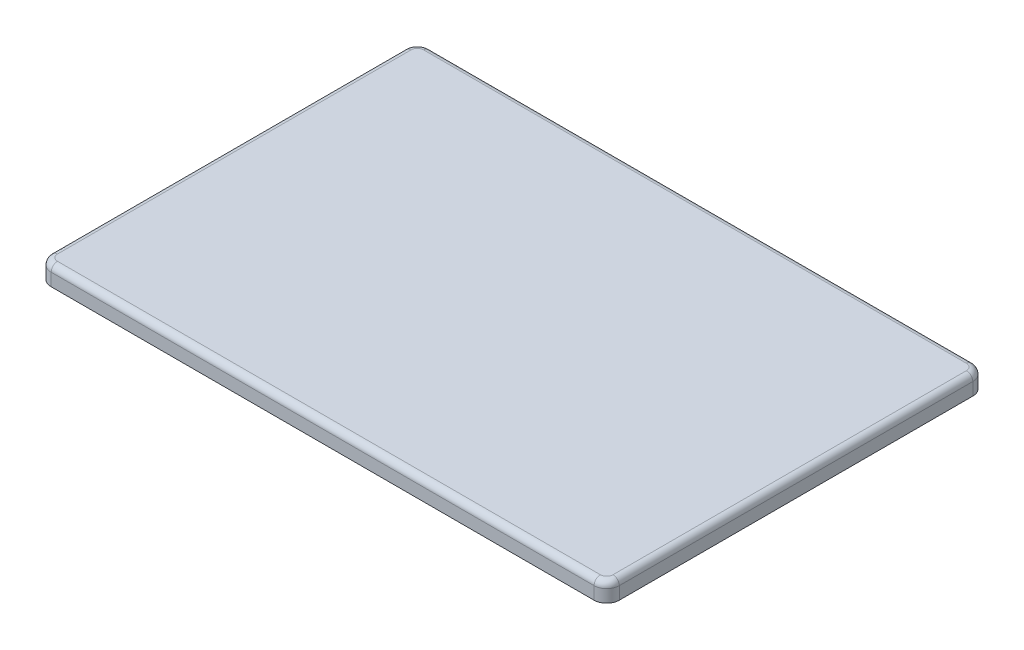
from build123d import *

# Parameters (mm, degrees)
EXTRUDE_1_DEPTH           = 1.5
FILLET_1_R                = 1
CUT_EXTRUDE_2_DEPTH       = 1
SKETCH_4_W                = 4.9
SKETCH_4_H                = 3.2
EXTRUDE_4_DEPTH           = 8
EXTRUDE_4_DRAFT           = 0.6
EXTRUDE_4_PROFILE_2_DEPTH = 8
EXTRUDE_4_PROFILE_2_DRAFT = 0.6
EXTRUDE_4_PROFILE_3_DEPTH = 8
EXTRUDE_4_PROFILE_3_DRAFT = 0.6
EXTRUDE_4_PROFILE_4_DEPTH = 8
EXTRUDE_4_PROFILE_4_DRAFT = 0.6
EXTRUDE_4_PROFILE_5_DEPTH = 8
EXTRUDE_4_PROFILE_5_DRAFT = 0.6
EXTRUDE_4_PROFILE_6_DEPTH = 8
EXTRUDE_4_PROFILE_6_DRAFT = 0.6
FILLET_2_R                = 0.8


with BuildPart() as part:
    # Sketch 1 → Extrude 1 (new, symmetric)
    with BuildSketch(Plane(origin=(0, 0, 0), x_dir=(0, 0, -1), z_dir=(0, 1, 0))):
        with BuildLine():
            Line((-28, 45), (28, 45))
            ThreePointArc((28, 45), (29.414213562, 44.414213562), (30, 43))
            Line((30, 43), (30, -43))
            ThreePointArc((30, -43), (29.414213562, -44.414213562), (28, -45))
            Line((28, -45), (-28, -45))
            ThreePointArc((-28, -45), (-29.414213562, -44.414213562), (-30, -43))
            Line((-30, -43), (-30, 43))
            ThreePointArc((-30, 43), (-29.414213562, 44.414213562), (-28, 45))
        make_face()
    extrude(amount=EXTRUDE_1_DEPTH, both=True)

    # Fillet 1
    fillet_1_edges = [part.edges().sort_by_distance(p)[0] for p in [
        (-44.414213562, 1.5, 29.414213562),
        (0, 1.5, 30),
        (44.414213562, 1.5, 29.414213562),
        (45, 1.5, 0),
        (44.414213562, 1.5, -29.414213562),
        (0, 1.5, -30),
        (-44.414213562, 1.5, -29.414213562),
        (-45, 1.5, 0),
    ]]
    fillet(fillet_1_edges, radius=FILLET_1_R)

    # Sketch 2 → Cut-Extrude 2 (cut)
    with BuildSketch(Plane.XZ.offset(1.5)):
        with BuildLine():
            Line((-43, 28.2), (43, 28.2))
            ThreePointArc((43, 28.2), (43.141421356, 28.141421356), (43.2, 28))
            Line((43.2, 28), (43.2, -28))
            ThreePointArc((43.2, -28), (43.141421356, -28.141421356), (43, -28.2))
            Line((43, -28.2), (-43, -28.2))
            ThreePointArc((-43, -28.2), (-43.141421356, -28.141421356), (-43.2, -28))
            Line((-43.2, -28), (-43.2, 28))
            ThreePointArc((-43.2, 28), (-43.141421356, 28.141421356), (-43, 28.2))
        make_face()
    extrude(amount=-CUT_EXTRUDE_2_DEPTH, mode=Mode.SUBTRACT)


with BuildPart() as extrude_4_tool:
    # Sketch 4 → Extrude 4 (with draft: the straight prism first)
    with BuildSketch(Plane.XZ.offset(0.5)):
        with Locations((-30, 15.85)):
            Rectangle(SKETCH_4_W, SKETCH_4_H)
    extrude(amount=EXTRUDE_4_DEPTH)
    # Extrude 4: the draft: its side faces are tilted about the plane it starts from
    extrude_4_sides = [extrude_4_tool.faces().sort_by_distance(p)[0] for p in [
        (-32.45, -4.5, 15.85),
        (-30, -4.5, 14.25),
        (-27.55, -4.5, 15.85),
        (-30, -4.5, 17.45),
    ]]
    draft(extrude_4_sides, Plane.XZ.offset(0.5), EXTRUDE_4_DRAFT)


with BuildPart() as part_1:
    add(part.part)

    # Extrude 4: add extrude_4_tool
    add(extrude_4_tool.part)


with BuildPart() as extrude_4_profile_2_tool:
    # Sketch 4 → Extrude 4 profile 2 (with draft: the straight prism first)
    with BuildSketch(Plane.XZ.offset(0.5)):
        with Locations((30, 15.85)):
            Rectangle(SKETCH_4_W, SKETCH_4_H)
    extrude(amount=EXTRUDE_4_PROFILE_2_DEPTH)
    # Extrude 4 profile 2: the draft: its side faces are tilted about the plane it starts from
    extrude_4_profile_2_sides = [extrude_4_profile_2_tool.faces().sort_by_distance(p)[0] for p in [
        (30, -4.5, 14.25),
        (32.45, -4.5, 15.85),
        (30, -4.5, 17.45),
        (27.55, -4.5, 15.85),
    ]]
    draft(extrude_4_profile_2_sides, Plane.XZ.offset(0.5), EXTRUDE_4_PROFILE_2_DRAFT)


with BuildPart() as part_2:
    add(part_1.part)

    # Extrude 4 profile 2: add extrude_4_profile_2_tool
    add(extrude_4_profile_2_tool.part)


with BuildPart() as extrude_4_profile_3_tool:
    # Sketch 4 → Extrude 4 profile 3 (with draft: the straight prism first)
    with BuildSketch(Plane.XZ.offset(0.5)):
        with Locations((-30, -15.85)):
            Rectangle(SKETCH_4_W, SKETCH_4_H)
    extrude(amount=EXTRUDE_4_PROFILE_3_DEPTH)
    # Extrude 4 profile 3: the draft: its side faces are tilted about the plane it starts from
    extrude_4_profile_3_sides = [extrude_4_profile_3_tool.faces().sort_by_distance(p)[0] for p in [
        (-32.45, -4.5, -15.85),
        (-30, -4.5, -17.45),
        (-27.55, -4.5, -15.85),
        (-30, -4.5, -14.25),
    ]]
    draft(extrude_4_profile_3_sides, Plane.XZ.offset(0.5), EXTRUDE_4_PROFILE_3_DRAFT)


with BuildPart() as part_3:
    add(part_2.part)

    # Extrude 4 profile 3: add extrude_4_profile_3_tool
    add(extrude_4_profile_3_tool.part)


with BuildPart() as extrude_4_profile_4_tool:
    # Sketch 4 → Extrude 4 profile 4 (with draft: the straight prism first)
    with BuildSketch(Plane.XZ.offset(0.5)):
        with Locations((30, -15.85)):
            Rectangle(SKETCH_4_W, SKETCH_4_H)
    extrude(amount=EXTRUDE_4_PROFILE_4_DEPTH)
    # Extrude 4 profile 4: the draft: its side faces are tilted about the plane it starts from
    extrude_4_profile_4_sides = [extrude_4_profile_4_tool.faces().sort_by_distance(p)[0] for p in [
        (27.55, -4.5, -15.85),
        (30, -4.5, -17.45),
        (32.45, -4.5, -15.85),
        (30, -4.5, -14.25),
    ]]
    draft(extrude_4_profile_4_sides, Plane.XZ.offset(0.5), EXTRUDE_4_PROFILE_4_DRAFT)


with BuildPart() as part_4:
    add(part_3.part)

    # Extrude 4 profile 4: add extrude_4_profile_4_tool
    add(extrude_4_profile_4_tool.part)


with BuildPart() as extrude_4_profile_5_tool:
    # Sketch 4 → Extrude 4 profile 5 (with draft: the straight prism first)
    with BuildSketch(Plane.XZ.offset(0.5)):
        with Locations((0, 15.85)):
            Rectangle(SKETCH_4_W, SKETCH_4_H)
    extrude(amount=EXTRUDE_4_PROFILE_5_DEPTH)
    # Extrude 4 profile 5: the draft: its side faces are tilted about the plane it starts from
    extrude_4_profile_5_sides = [extrude_4_profile_5_tool.faces().sort_by_distance(p)[0] for p in [
        (-2.45, -4.5, 15.85),
        (0, -4.5, 14.25),
        (2.45, -4.5, 15.85),
        (0, -4.5, 17.45),
    ]]
    draft(extrude_4_profile_5_sides, Plane.XZ.offset(0.5), EXTRUDE_4_PROFILE_5_DRAFT)


with BuildPart() as part_5:
    add(part_4.part)

    # Extrude 4 profile 5: add extrude_4_profile_5_tool
    add(extrude_4_profile_5_tool.part)


with BuildPart() as extrude_4_profile_6_tool:
    # Sketch 4 → Extrude 4 profile 6 (with draft: the straight prism first)
    with BuildSketch(Plane.XZ.offset(0.5)):
        with Locations((0, -15.85)):
            Rectangle(SKETCH_4_W, SKETCH_4_H)
    extrude(amount=EXTRUDE_4_PROFILE_6_DEPTH)
    # Extrude 4 profile 6: the draft: its side faces are tilted about the plane it starts from
    extrude_4_profile_6_sides = [extrude_4_profile_6_tool.faces().sort_by_distance(p)[0] for p in [
        (-2.45, -4.5, -15.85),
        (0, -4.5, -17.45),
        (2.45, -4.5, -15.85),
        (0, -4.5, -14.25),
    ]]
    draft(extrude_4_profile_6_sides, Plane.XZ.offset(0.5), EXTRUDE_4_PROFILE_6_DRAFT)


with BuildPart() as part_6:
    add(part_5.part)

    # Extrude 4 profile 6: add extrude_4_profile_6_tool
    add(extrude_4_profile_6_tool.part)

    # Fillet 2
    fillet_2_edges = [part_6.edges().sort_by_distance(p)[0] for p in [
        (27.633778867, -8.5, -15.85),
        (30, -8.5, -17.366221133),
        (32.366221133, -8.5, -15.85),
        (30, -8.5, -14.333778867),
        (-2.366221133, -8.5, 15.85),
        (0, -8.5, 14.333778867),
        (2.366221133, -8.5, 15.85),
        (0, -8.5, 17.366221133),
        (-2.366221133, -8.5, -15.85),
        (0, -8.5, -17.366221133),
        (2.366221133, -8.5, -15.85),
        (0, -8.5, -14.333778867),
        (-32.366221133, -8.5, 15.85),
        (-30, -8.5, 14.333778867),
        (-27.633778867, -8.5, 15.85),
        (-30, -8.5, 17.366221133),
        (27.633778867, -8.5, 15.85),
        (30, -8.5, 14.333778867),
        (32.366221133, -8.5, 15.85),
        (30, -8.5, 17.366221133),
        (-32.366221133, -8.5, -15.85),
        (-30, -8.5, -17.366221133),
        (-27.633778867, -8.5, -15.85),
        (-30, -8.5, -14.333778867),
    ]]
    fillet(fillet_2_edges, radius=FILLET_2_R)


solid = part_6.part
